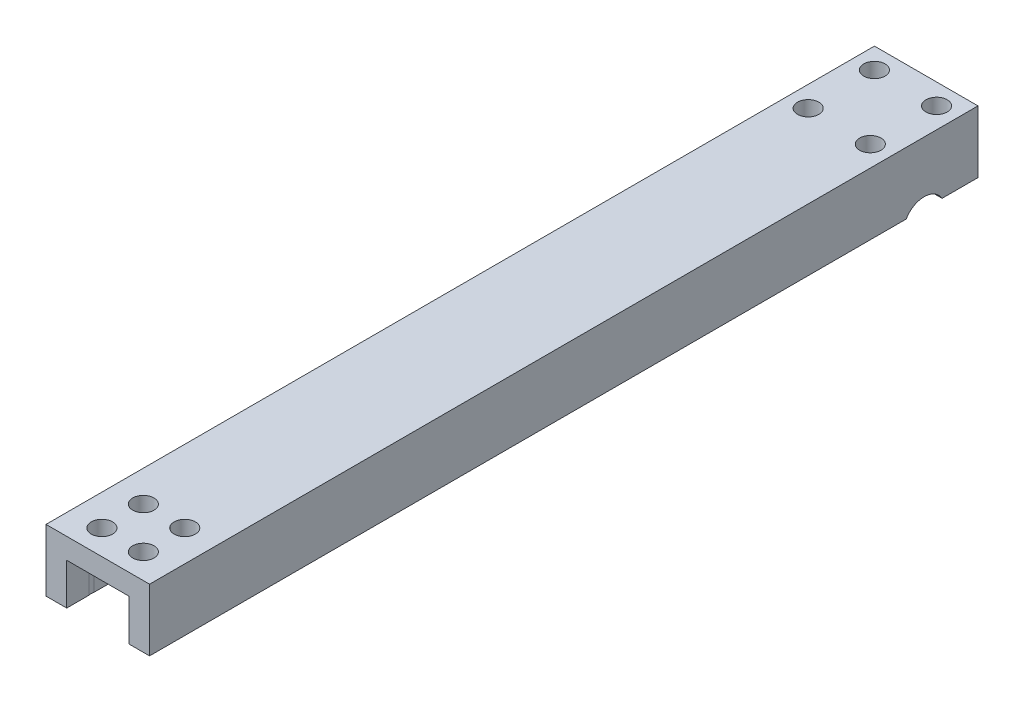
from build123d import *

# Parameters (mm, degrees)
SKETCH1_W             = 15.875
SKETCH1_H             = 9.525
EXTRUDE1_DEPTH        = 63.5
F_4_CLEARANCE_HOLE1_D = 3.2639
CUT_EXTRUDE1_START    = -20.32
SKETCH4_W             = 9.525
SKETCH4_H             = 16.724970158
CUT_EXTRUDE1_DEPTH    = 108.283799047
F_4_CLEARANCE_HOLE2_D = 3.2639
SKETCH7_R             = 3.175
CUT_EXTRUDE2_DEPTH    = 67.143716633


with BuildPart() as part:
    # Sketch1 → Extrude1 (new, symmetric)
    with BuildSketch(Plane.XY):
        with Locations((0, 4.7625)):
            Rectangle(SKETCH1_W, SKETCH1_H)
    extrude(amount=EXTRUDE1_DEPTH, both=True)

    # 4 Clearance Hole1 (through all)
    with Locations(Plane(origin=(0, 9.525, 0), x_dir=(-1, 0, 0), z_dir=(0, 1, 0))):
        with Locations((3.175, 59.69), (3.175, 53.34), (-3.175, 53.34), (-3.175, 59.69)):
            Hole(F_4_CLEARANCE_HOLE1_D / 2)

    # Sketch4 → Cut-Extrude1 (cut, through all)
    with BuildSketch(Plane(origin=(0, 0, -63.5), x_dir=(-1, 0, 0), z_dir=(0, 0, -1)).offset(CUT_EXTRUDE1_START)):
        with Locations((0, -2.012485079)):
            Rectangle(SKETCH4_W, SKETCH4_H)
    extrude(amount=-CUT_EXTRUDE1_DEPTH, mode=Mode.SUBTRACT)

    # 4 Clearance Hole2 (through all)
    with Locations(Plane(origin=(0, 9.525, 0), x_dir=(-1, 0, 0), z_dir=(0, 1, 0))):
        with Locations((-4.7625, -50.165), (-4.7625, -60.325), (4.7625, -60.325), (4.7625, -50.165)):
            Hole(F_4_CLEARANCE_HOLE2_D / 2)

    # Sketch7 → Cut-Extrude2 (cut, through all)
    with BuildSketch(Plane(origin=(7.9375, 0, 0), x_dir=(0, 0, -1), z_dir=(1, 0, 0))):
        with Locations((55.245, -1.5875)):
            Circle(SKETCH7_R)
    extrude(amount=-CUT_EXTRUDE2_DEPTH, mode=Mode.SUBTRACT)


solid = part.part
